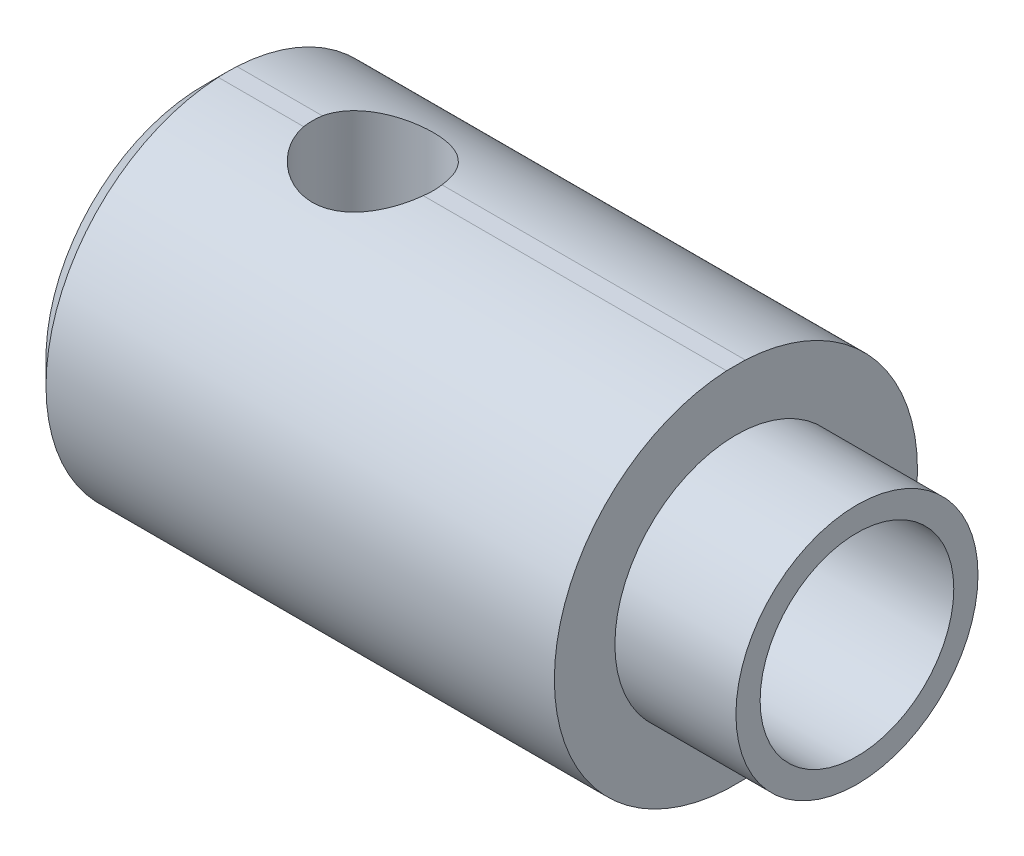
from build123d import *

# Parameters (mm, degrees)
SKETCH2_R          = 2.5
CUT_EXTRUDE1_DEPTH = 10
CUT_EXTRUDE2_DEPTH = 25.423349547


with BuildPart() as part:
    # Sketch1 → Revolve1 (revolve)
    with BuildSketch(Plane(origin=(0, 0, 0), x_dir=(1, 0, 0), z_dir=(0, 1, 0))):
        Polygon((20, 4), (20, 5), (15, 5), (15, 7.5), (0, 7.5), (-6, 7.5), (-7, 6.5), (-7, 0), (-2.309401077, 0), (0, 4), align=None)
    revolve(axis=Axis((-2.309401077, 0, 0), (-1, 0, 0)))

    # Sketch2 → Cut-Extrude1 (cut, symmetric)
    with BuildSketch(Plane(origin=(0, 0, 0), x_dir=(1, 0, 0), z_dir=(0, 1, 0))):
        with Locations(Location((0, 0, 0), (0, 0, 270))):
            Circle(SKETCH2_R)
    extrude(amount=CUT_EXTRUDE1_DEPTH, both=True, mode=Mode.SUBTRACT)

    # Sketch3 → Cut-Extrude2 (cut, through all)
    with BuildSketch(Plane(origin=(15, 0, 0), x_dir=(0, 0, -1), z_dir=(1, 0, 0))):
        with BuildLine():
            Line((0.387169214, 7.49), (-0.387169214, 7.49))
            ThreePointArc((-0.387169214, 7.49), (0, 7.5), (0.387169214, 7.49))
        make_face()
        with BuildLine():
            Line((0.387169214, -7.49), (-0.387169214, -7.49))
            ThreePointArc((-0.387169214, -7.49), (0, -7.5), (0.387169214, -7.49))
        make_face()
    extrude(amount=-CUT_EXTRUDE2_DEPTH, mode=Mode.SUBTRACT)


solid = part.part
